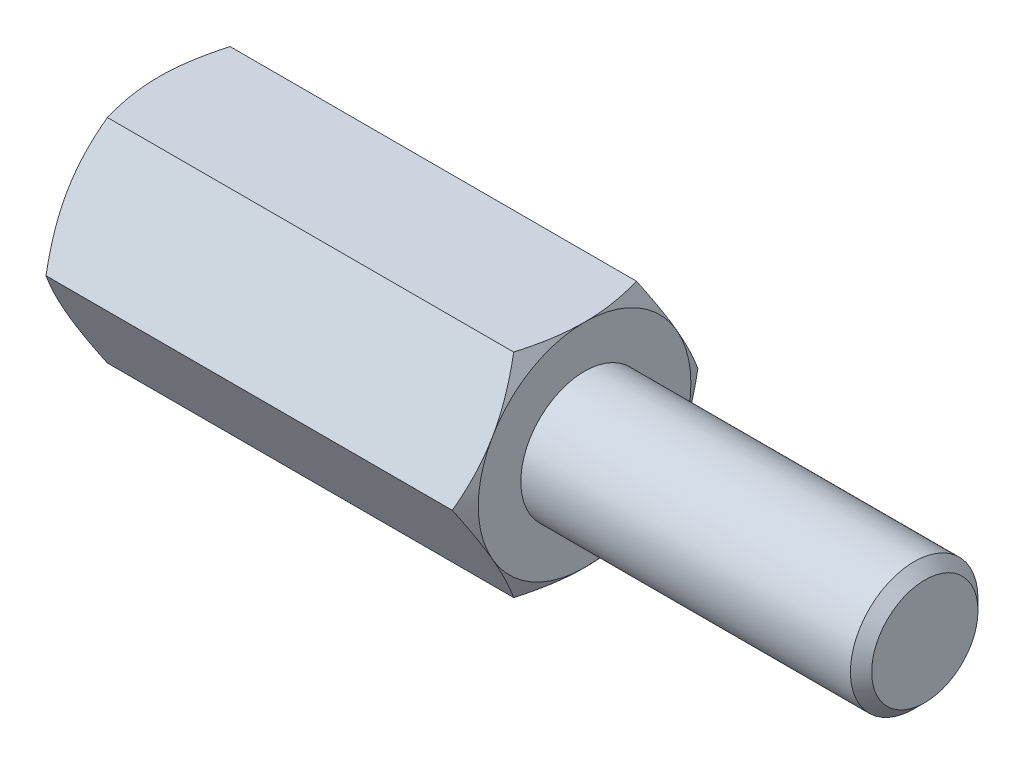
from build123d import *

# Parameters (mm, degrees)
EXTRUDE2_DEPTH = 5
SKETCH3_R      = 1.25
EXTRUDE3_DEPTH = 5
SKETCH5_R      = 1.5
EXTRUDE4_DEPTH = 8
CHAMFER1_SIZE  = 0.25


with BuildPart() as part:
    # Sketch1 → Extrude2 (new, symmetric)
    with BuildSketch(Plane(origin=(0, 0, 0), x_dir=(0, 0, -1), z_dir=(1, 0, 0))):
        Polygon((1.443375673, 2.5), (-1.443375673, 2.5), (-2.886751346, 0), (-1.443375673, -2.5), (1.443375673, -2.5), (2.886751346, 0), align=None)
    extrude(amount=EXTRUDE2_DEPTH, both=True)

    # Sketch2 → Cut-Revolve1 (revolve, cut)
    with BuildSketch(Plane.XY):
        with BuildLine():
            Line((-5, 2.5), (-3.5, 5.098076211))
            ThreePointArc((-3.5, 5.098076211), (-3.98810136, 6.276457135), (-5, 5.5))
            Line((-5, 5.5), (-5, 2.5))
        make_face()
    cut_revolve1 = revolve(axis=Axis((0, 0, 0), (1, 0, 0)), mode=Mode.SUBTRACT)

    # Mirror1: Cut-Revolve1 across plane
    add(cut_revolve1.mirror(Plane(origin=(0, 0, 0), x_dir=(0, 0, 1), z_dir=(1, 0, 0))), mode=Mode.SUBTRACT)

    # Sketch3 → Extrude3 (cut)
    with BuildSketch(Plane.ZY.offset(5)):
        Circle(SKETCH3_R)
    extrude(amount=-EXTRUDE3_DEPTH, mode=Mode.SUBTRACT)

    # Sketch4 → Cut-Revolve2 (revolve, cut)
    with BuildSketch(Plane.XY, mode=Mode.PRIVATE) as cut_revolve2_sk:
        Polygon((0, 0), (0, 1.25), (0.721687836, 0), align=None)
    revolve(cut_revolve2_sk.sketch.rotate(Axis((0.721687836, 0, 0), (-1, 0, 0)), 270), axis=Axis((0.721687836, 0, 0), (-1, 0, 0)), mode=Mode.SUBTRACT)

    # Sketch5 → Extrude4 (add)
    with BuildSketch(Plane(origin=(5, 0, 0), x_dir=(0, 0, -1), z_dir=(1, 0, 0))):
        Circle(SKETCH5_R)
    extrude(amount=EXTRUDE4_DEPTH)

    # Chamfer1
    chamfer1_edges = [part.edges().sort_by_distance(p)[0] for p in [
        (13, 0, 1.5),
    ]]
    chamfer(chamfer1_edges, length=CHAMFER1_SIZE)


solid = part.part
